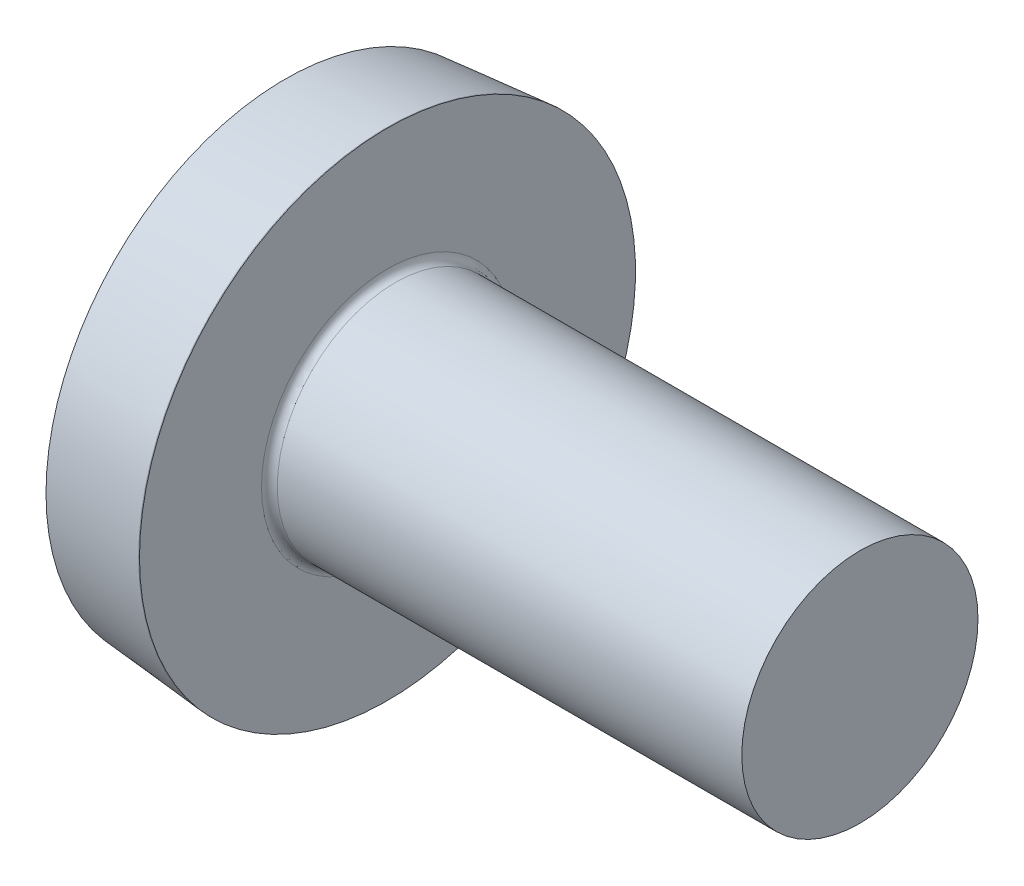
from build123d import *

# Parameters (mm, degrees)
FILLET1_R    = 0.1
RECPAT_COUNT = 2
RECPAT_ANGLE = 90


with BuildPart() as part:
    # BodySke → Base-Revolve (revolve)
    with BuildSketch(Plane.XY, mode=Mode.PRIVATE) as base_revolve_sk:
        with BuildLine():
            Line((1.9, 1.5), (1.9, 3.15))
            Line((1.9, 3.15), (1.89, 3.15))
            Line((1.89, 3.15), (0.6, 3.037139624))
            ThreePointArc((0.6, 3.037139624), (0.151435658, 1.547919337), (0, 0))
            Line((0, 0), (7.9, 0))
            Line((7.9, 0), (7.9, 1.5))
            Line((7.9, 1.5), (1.9, 1.5))
        make_face()
    revolve(base_revolve_sk.sketch.rotate(Axis((0.6, 0, 0), (1, 0, 0)), 90), axis=Axis((0.6, 0, 0), (1, 0, 0)))

    # Fillet1
    fillet1_edges = [part.edges().sort_by_distance(p)[0] for p in [
        (1.9, 0, -1.5),
    ]]
    fillet(fillet1_edges, radius=FILLET1_R)

    # Sketch3 → Recess section 0
    with BuildSketch(Plane(origin=(0, 0, 0), x_dir=(0, 0, -1), z_dir=(1, 0, 0))):
        with BuildLine():
            Line((0.515, -1.85), (-0.515, -1.85))
            Line((-0.515, -1.85), (-0.515, 1.85))
            Line((-0.515, 1.85), (0.515, 1.85))
            Line((0.515, 1.85), (0.515, -1.85))
        make_face()
    # Sketch4 → Recess section 1
    with BuildSketch(Plane(origin=(1.53, 0, 0), x_dir=(0, 0, -1), z_dir=(1, 0, 0))):
        with BuildLine():
            Line((0.515, -1.087170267), (-0.515, -1.087170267))
            Line((-0.515, -1.087170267), (-0.515, 1.087170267))
            Line((-0.515, 1.087170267), (0.515, 1.087170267))
            Line((0.515, 1.087170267), (0.515, -1.087170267))
        make_face()
    recess = loft(mode=Mode.SUBTRACT)

    # RecPat: Recess ×2 about axis
    recpat_axis = Axis((0, 0, 0), (1, 0, 0))
    for i in range(1, RECPAT_COUNT):
        add(recess.rotate(recpat_axis, i * RECPAT_ANGLE / (RECPAT_COUNT - 1)), mode=Mode.SUBTRACT)

    # RecCorSke → RecessCore (revolve, cut)
    with BuildSketch(Plane.XY, mode=Mode.PRIVATE) as recesscore_sk:
        Polygon((0, 0), (0, 0.957988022), (1.53, 0.851), (1.806506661, 0), align=None)
    revolve(recesscore_sk.sketch.rotate(Axis((-3.175, 0, 0), (1, 0, 0)), 343.559564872), axis=Axis((-3.175, 0, 0), (1, 0, 0)), mode=Mode.SUBTRACT)


solid = part.part
